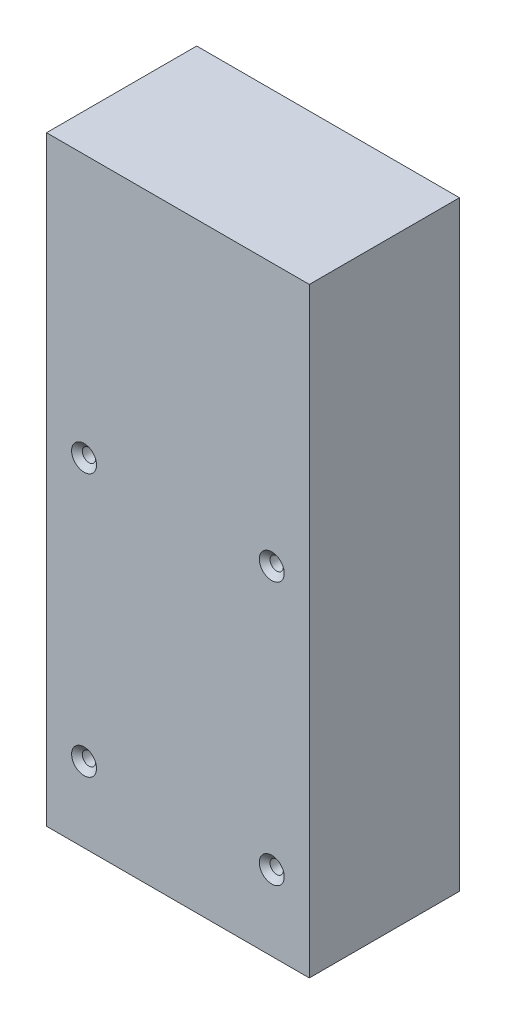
ISO-10303-21;
HEADER;
FILE_DESCRIPTION(('STEP AP214'),'2;1');
FILE_NAME('part.step','',(''),(''),'','','');
FILE_SCHEMA(('AUTOMOTIVE_DESIGN { 1 0 10303 214 1 1 1 1 }'));
ENDSEC;
DATA;
#1=APPLICATION_CONTEXT('core data for automotive mechanical design processes');
#2=APPLICATION_PROTOCOL_DEFINITION('international standard','automotive_design',2000,#1);
#3=PRODUCT_CONTEXT('',#1,'mechanical');
#4=PRODUCT('Part','Part','',(#3));
#5=PRODUCT_RELATED_PRODUCT_CATEGORY('part','',(#4));
#6=PRODUCT_DEFINITION_FORMATION('','',#4);
#7=PRODUCT_DEFINITION_CONTEXT('part definition',#1,'design');
#8=PRODUCT_DEFINITION('design','',#6,#7);
#9=PRODUCT_DEFINITION_SHAPE('','',#8);
#10=(LENGTH_UNIT() NAMED_UNIT(*) SI_UNIT(.MILLI.,.METRE.));
#11=(NAMED_UNIT(*) PLANE_ANGLE_UNIT() SI_UNIT($,.RADIAN.));
#12=(NAMED_UNIT(*) SI_UNIT($,.STERADIAN.) SOLID_ANGLE_UNIT());
#13=UNCERTAINTY_MEASURE_WITH_UNIT(LENGTH_MEASURE(1.E-05),#10,'distance_accuracy_value','');
#14=(GEOMETRIC_REPRESENTATION_CONTEXT(3) GLOBAL_UNCERTAINTY_ASSIGNED_CONTEXT((#13)) GLOBAL_UNIT_ASSIGNED_CONTEXT((#10,
#11,#12)) REPRESENTATION_CONTEXT('',''));
#15=CARTESIAN_POINT('',(0.,0.,0.));
#16=DIRECTION('',(0.,0.,1.));
#17=DIRECTION('',(1.,0.,0.));
#18=AXIS2_PLACEMENT_3D('',#15,#16,#17);
#19=CARTESIAN_POINT('',(44.45,203.2,-25.4));
#20=DIRECTION('',(-1.,0.,0.));
#21=DIRECTION('',(0.,0.,1.));
#22=AXIS2_PLACEMENT_3D('',#19,#20,#21);
#23=PLANE('',#22);
#24=DIRECTION('',(0.,0.,-1.));
#25=VECTOR('',#24,1.);
#26=CARTESIAN_POINT('',(44.45,0.,-25.4));
#27=LINE('',#26,#25);
#28=CARTESIAN_POINT('',(44.45,0.,25.4));
#29=VERTEX_POINT('',#28);
#30=CARTESIAN_POINT('',(44.45,0.,-25.4));
#31=VERTEX_POINT('',#30);
#32=EDGE_CURVE('E97',#29,#31,#27,.T.);
#33=ORIENTED_EDGE('',*,*,#32,.T.);
#34=DIRECTION('',(0.,-1.,0.));
#35=VECTOR('',#34,1.);
#36=CARTESIAN_POINT('',(44.45,203.2,-25.4));
#37=LINE('',#36,#35);
#38=CARTESIAN_POINT('',(44.45,203.2,-25.4));
#39=VERTEX_POINT('',#38);
#40=EDGE_CURVE('E11',#39,#31,#37,.T.);
#41=ORIENTED_EDGE('',*,*,#40,.F.);
#42=DIRECTION('',(0.,0.,-1.));
#43=VECTOR('',#42,1.);
#44=CARTESIAN_POINT('',(44.45,203.2,-25.4));
#45=LINE('',#44,#43);
#46=CARTESIAN_POINT('',(44.45,203.2,25.4));
#47=VERTEX_POINT('',#46);
#48=EDGE_CURVE('E85',#47,#39,#45,.T.);
#49=ORIENTED_EDGE('',*,*,#48,.F.);
#50=DIRECTION('',(0.,-1.,0.));
#51=VECTOR('',#50,1.);
#52=CARTESIAN_POINT('',(44.45,203.2,25.4));
#53=LINE('',#52,#51);
#54=EDGE_CURVE('E93',#47,#29,#53,.T.);
#55=ORIENTED_EDGE('',*,*,#54,.T.);
#56=EDGE_LOOP('',(#33,#41,#49,#55));
#57=FACE_BOUND('',#56,.T.);
#58=ADVANCED_FACE('F34',(#57),#23,.F.);
#59=CARTESIAN_POINT('',(-44.45,203.2,-25.4));
#60=DIRECTION('',(0.,0.,1.));
#61=DIRECTION('',(1.,0.,0.));
#62=AXIS2_PLACEMENT_3D('',#59,#60,#61);
#63=PLANE('',#62);
#64=CARTESIAN_POINT('',(-31.75,25.4,-25.4));
#65=DIRECTION('',(0.,0.,1.));
#66=DIRECTION('',(1.,0.,0.));
#67=AXIS2_PLACEMENT_3D('',#64,#65,#66);
#68=CIRCLE('',#67,2.24789999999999);
#69=CARTESIAN_POINT('',(-29.5021,25.4,-25.4));
#70=VERTEX_POINT('',#69);
#71=EDGE_CURVE('E137',#70,#70,#68,.T.);
#72=ORIENTED_EDGE('',*,*,#71,.T.);
#73=EDGE_LOOP('',(#72));
#74=FACE_BOUND('',#73,.T.);
#75=CARTESIAN_POINT('',(31.75,25.4,-25.4));
#76=DIRECTION('',(0.,0.,1.));
#77=DIRECTION('',(1.,0.,0.));
#78=AXIS2_PLACEMENT_3D('',#75,#76,#77);
#79=CIRCLE('',#78,2.24789999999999);
#80=CARTESIAN_POINT('',(33.9979,25.4,-25.4));
#81=VERTEX_POINT('',#80);
#82=EDGE_CURVE('E128',#81,#81,#79,.T.);
#83=ORIENTED_EDGE('',*,*,#82,.T.);
#84=EDGE_LOOP('',(#83));
#85=FACE_BOUND('',#84,.T.);
#86=CARTESIAN_POINT('',(-31.75,114.3,-25.4));
#87=DIRECTION('',(0.,0.,1.));
#88=DIRECTION('',(1.,0.,0.));
#89=AXIS2_PLACEMENT_3D('',#86,#87,#88);
#90=CIRCLE('',#89,2.24789999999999);
#91=CARTESIAN_POINT('',(-29.5021,114.3,-25.4));
#92=VERTEX_POINT('',#91);
#93=EDGE_CURVE('E119',#92,#92,#90,.T.);
#94=ORIENTED_EDGE('',*,*,#93,.T.);
#95=EDGE_LOOP('',(#94));
#96=FACE_BOUND('',#95,.T.);
#97=CARTESIAN_POINT('',(31.75,114.3,-25.4));
#98=DIRECTION('',(0.,0.,1.));
#99=DIRECTION('',(1.,0.,0.));
#100=AXIS2_PLACEMENT_3D('',#97,#98,#99);
#101=CIRCLE('',#100,2.24789999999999);
#102=CARTESIAN_POINT('',(33.9979,114.3,-25.4));
#103=VERTEX_POINT('',#102);
#104=EDGE_CURVE('E100',#103,#103,#101,.T.);
#105=ORIENTED_EDGE('',*,*,#104,.T.);
#106=EDGE_LOOP('',(#105));
#107=FACE_BOUND('',#106,.T.);
#108=DIRECTION('',(-1.,0.,0.));
#109=VECTOR('',#108,1.);
#110=CARTESIAN_POINT('',(-44.45,0.,-25.4));
#111=LINE('',#110,#109);
#112=CARTESIAN_POINT('',(-44.45,0.,-25.4));
#113=VERTEX_POINT('',#112);
#114=EDGE_CURVE('E89',#31,#113,#111,.T.);
#115=ORIENTED_EDGE('',*,*,#114,.T.);
#116=DIRECTION('',(0.,-1.,0.));
#117=VECTOR('',#116,1.);
#118=CARTESIAN_POINT('',(-44.45,203.2,-25.4));
#119=LINE('',#118,#117);
#120=CARTESIAN_POINT('',(-44.45,203.2,-25.4));
#121=VERTEX_POINT('',#120);
#122=EDGE_CURVE('E42',#121,#113,#119,.T.);
#123=ORIENTED_EDGE('',*,*,#122,.F.);
#124=DIRECTION('',(-1.,0.,0.));
#125=VECTOR('',#124,1.);
#126=CARTESIAN_POINT('',(-44.45,203.2,-25.4));
#127=LINE('',#126,#125);
#128=EDGE_CURVE('E80',#39,#121,#127,.T.);
#129=ORIENTED_EDGE('',*,*,#128,.F.);
#130=ORIENTED_EDGE('',*,*,#40,.T.);
#131=EDGE_LOOP('',(#115,#123,#129,#130));
#132=FACE_BOUND('',#131,.T.);
#133=ADVANCED_FACE('F88',(#74,#85,#96,#107,#132),#63,.F.);
#134=CARTESIAN_POINT('',(-44.45,203.2,-25.4));
#135=DIRECTION('',(1.,0.,0.));
#136=DIRECTION('',(0.,0.,-1.));
#137=AXIS2_PLACEMENT_3D('',#134,#135,#136);
#138=PLANE('',#137);
#139=DIRECTION('',(0.,0.,1.));
#140=VECTOR('',#139,1.);
#141=CARTESIAN_POINT('',(-44.45,0.,-25.4));
#142=LINE('',#141,#140);
#143=CARTESIAN_POINT('',(-44.45,0.,25.4));
#144=VERTEX_POINT('',#143);
#145=EDGE_CURVE('E67',#113,#144,#142,.T.);
#146=ORIENTED_EDGE('',*,*,#145,.T.);
#147=DIRECTION('',(0.,-1.,0.));
#148=VECTOR('',#147,1.);
#149=CARTESIAN_POINT('',(-44.45,203.2,25.4));
#150=LINE('',#149,#148);
#151=CARTESIAN_POINT('',(-44.45,203.2,25.4));
#152=VERTEX_POINT('',#151);
#153=EDGE_CURVE('E90',#152,#144,#150,.T.);
#154=ORIENTED_EDGE('',*,*,#153,.F.);
#155=DIRECTION('',(0.,0.,1.));
#156=VECTOR('',#155,1.);
#157=CARTESIAN_POINT('',(-44.45,203.2,-25.4));
#158=LINE('',#157,#156);
#159=EDGE_CURVE('E83',#121,#152,#158,.T.);
#160=ORIENTED_EDGE('',*,*,#159,.F.);
#161=ORIENTED_EDGE('',*,*,#122,.T.);
#162=EDGE_LOOP('',(#146,#154,#160,#161));
#163=FACE_BOUND('',#162,.T.);
#164=ADVANCED_FACE('F91',(#163),#138,.F.);
#165=CARTESIAN_POINT('',(-44.45,203.2,25.4));
#166=DIRECTION('',(0.,0.,-1.));
#167=DIRECTION('',(-1.,0.,0.));
#168=AXIS2_PLACEMENT_3D('',#165,#166,#167);
#169=PLANE('',#168);
#170=CARTESIAN_POINT('',(-31.75,25.4,25.4));
#171=DIRECTION('',(0.,0.,1.));
#172=DIRECTION('',(1.,0.,0.));
#173=AXIS2_PLACEMENT_3D('',#170,#171,#172);
#174=CIRCLE('',#173,4.2164);
#175=CARTESIAN_POINT('',(-27.5336,25.4,25.4));
#176=VERTEX_POINT('',#175);
#177=EDGE_CURVE('E143',#176,#176,#174,.T.);
#178=ORIENTED_EDGE('',*,*,#177,.F.);
#179=EDGE_LOOP('',(#178));
#180=FACE_BOUND('',#179,.T.);
#181=CARTESIAN_POINT('',(31.75,25.4,25.4));
#182=DIRECTION('',(0.,0.,1.));
#183=DIRECTION('',(1.,0.,0.));
#184=AXIS2_PLACEMENT_3D('',#181,#182,#183);
#185=CIRCLE('',#184,4.2164);
#186=CARTESIAN_POINT('',(35.9664,25.4,25.4));
#187=VERTEX_POINT('',#186);
#188=EDGE_CURVE('E134',#187,#187,#185,.T.);
#189=ORIENTED_EDGE('',*,*,#188,.F.);
#190=EDGE_LOOP('',(#189));
#191=FACE_BOUND('',#190,.T.);
#192=CARTESIAN_POINT('',(-31.75,114.3,25.4));
#193=DIRECTION('',(0.,0.,1.));
#194=DIRECTION('',(1.,0.,0.));
#195=AXIS2_PLACEMENT_3D('',#192,#193,#194);
#196=CIRCLE('',#195,4.2164);
#197=CARTESIAN_POINT('',(-27.5336,114.3,25.4));
#198=VERTEX_POINT('',#197);
#199=EDGE_CURVE('E125',#198,#198,#196,.T.);
#200=ORIENTED_EDGE('',*,*,#199,.F.);
#201=EDGE_LOOP('',(#200));
#202=FACE_BOUND('',#201,.T.);
#203=CARTESIAN_POINT('',(31.75,114.3,25.4));
#204=DIRECTION('',(0.,0.,1.));
#205=DIRECTION('',(1.,0.,0.));
#206=AXIS2_PLACEMENT_3D('',#203,#204,#205);
#207=CIRCLE('',#206,4.2164);
#208=CARTESIAN_POINT('',(35.9664,114.3,25.4));
#209=VERTEX_POINT('',#208);
#210=EDGE_CURVE('E116',#209,#209,#207,.T.);
#211=ORIENTED_EDGE('',*,*,#210,.F.);
#212=EDGE_LOOP('',(#211));
#213=FACE_BOUND('',#212,.T.);
#214=DIRECTION('',(1.,0.,0.));
#215=VECTOR('',#214,1.);
#216=CARTESIAN_POINT('',(-44.45,0.,25.4));
#217=LINE('',#216,#215);
#218=EDGE_CURVE('E73',#144,#29,#217,.T.);
#219=ORIENTED_EDGE('',*,*,#218,.T.);
#220=ORIENTED_EDGE('',*,*,#54,.F.);
#221=DIRECTION('',(1.,0.,0.));
#222=VECTOR('',#221,1.);
#223=CARTESIAN_POINT('',(-44.45,203.2,25.4));
#224=LINE('',#223,#222);
#225=EDGE_CURVE('E50',#152,#47,#224,.T.);
#226=ORIENTED_EDGE('',*,*,#225,.F.);
#227=ORIENTED_EDGE('',*,*,#153,.T.);
#228=EDGE_LOOP('',(#219,#220,#226,#227));
#229=FACE_BOUND('',#228,.T.);
#230=ADVANCED_FACE('F105',(#180,#191,#202,#213,#229),#169,.F.);
#231=CARTESIAN_POINT('',(0.,203.2,0.));
#232=DIRECTION('',(0.,1.,0.));
#233=DIRECTION('',(0.,0.,1.));
#234=AXIS2_PLACEMENT_3D('',#231,#232,#233);
#235=PLANE('',#234);
#236=ORIENTED_EDGE('',*,*,#48,.T.);
#237=ORIENTED_EDGE('',*,*,#128,.T.);
#238=ORIENTED_EDGE('',*,*,#159,.T.);
#239=ORIENTED_EDGE('',*,*,#225,.T.);
#240=EDGE_LOOP('',(#236,#237,#238,#239));
#241=FACE_BOUND('',#240,.T.);
#242=ADVANCED_FACE('F81',(#241),#235,.T.);
#243=CARTESIAN_POINT('',(0.,0.,0.));
#244=DIRECTION('',(0.,1.,0.));
#245=DIRECTION('',(0.,0.,1.));
#246=AXIS2_PLACEMENT_3D('',#243,#244,#245);
#247=PLANE('',#246);
#248=ORIENTED_EDGE('',*,*,#32,.F.);
#249=ORIENTED_EDGE('',*,*,#218,.F.);
#250=ORIENTED_EDGE('',*,*,#145,.F.);
#251=ORIENTED_EDGE('',*,*,#114,.F.);
#252=EDGE_LOOP('',(#248,#249,#250,#251));
#253=FACE_BOUND('',#252,.T.);
#254=ADVANCED_FACE('F108',(#253),#247,.F.);
#255=CARTESIAN_POINT('',(31.75,114.3,25.4));
#256=DIRECTION('',(0.,0.,1.));
#257=DIRECTION('',(1.,0.,0.));
#258=AXIS2_PLACEMENT_3D('',#255,#256,#257);
#259=CYLINDRICAL_SURFACE('',#258,2.24789999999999);
#260=ORIENTED_EDGE('',*,*,#104,.F.);
#261=EDGE_LOOP('',(#260));
#262=FACE_BOUND('',#261,.T.);
#263=CARTESIAN_POINT('',(31.75,114.3,23.7482323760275));
#264=DIRECTION('',(0.,0.,1.));
#265=DIRECTION('',(1.,0.,0.));
#266=AXIS2_PLACEMENT_3D('',#263,#264,#265);
#267=CIRCLE('',#266,2.24789999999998);
#268=CARTESIAN_POINT('',(33.9979,114.3,23.7482323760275));
#269=VERTEX_POINT('',#268);
#270=EDGE_CURVE('E113',#269,#269,#267,.T.);
#271=ORIENTED_EDGE('',*,*,#270,.T.);
#272=EDGE_LOOP('',(#271));
#273=FACE_BOUND('',#272,.T.);
#274=ADVANCED_FACE('F161',(#262,#273),#259,.F.);
#275=CARTESIAN_POINT('',(31.75,114.3,25.4));
#276=DIRECTION('',(0.,0.,1.));
#277=DIRECTION('',(1.,0.,0.));
#278=AXIS2_PLACEMENT_3D('',#275,#276,#277);
#279=CONICAL_SURFACE('',#278,4.2164,0.872664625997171);
#280=ORIENTED_EDGE('',*,*,#270,.F.);
#281=EDGE_LOOP('',(#280));
#282=FACE_BOUND('',#281,.T.);
#283=ORIENTED_EDGE('',*,*,#210,.T.);
#284=EDGE_LOOP('',(#283));
#285=FACE_BOUND('',#284,.T.);
#286=ADVANCED_FACE('F158',(#282,#285),#279,.F.);
#287=CARTESIAN_POINT('',(-31.75,114.3,25.4));
#288=DIRECTION('',(0.,0.,1.));
#289=DIRECTION('',(1.,0.,0.));
#290=AXIS2_PLACEMENT_3D('',#287,#288,#289);
#291=CYLINDRICAL_SURFACE('',#290,2.24789999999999);
#292=ORIENTED_EDGE('',*,*,#93,.F.);
#293=EDGE_LOOP('',(#292));
#294=FACE_BOUND('',#293,.T.);
#295=CARTESIAN_POINT('',(-31.75,114.3,23.7482323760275));
#296=DIRECTION('',(0.,0.,1.));
#297=DIRECTION('',(1.,0.,0.));
#298=AXIS2_PLACEMENT_3D('',#295,#296,#297);
#299=CIRCLE('',#298,2.24789999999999);
#300=CARTESIAN_POINT('',(-29.5021,114.3,23.7482323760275));
#301=VERTEX_POINT('',#300);
#302=EDGE_CURVE('E122',#301,#301,#299,.T.);
#303=ORIENTED_EDGE('',*,*,#302,.T.);
#304=EDGE_LOOP('',(#303));
#305=FACE_BOUND('',#304,.T.);
#306=ADVANCED_FACE('F160',(#294,#305),#291,.F.);
#307=CARTESIAN_POINT('',(-31.75,114.3,25.4));
#308=DIRECTION('',(0.,0.,1.));
#309=DIRECTION('',(1.,0.,0.));
#310=AXIS2_PLACEMENT_3D('',#307,#308,#309);
#311=CONICAL_SURFACE('',#310,4.2164,0.872664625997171);
#312=ORIENTED_EDGE('',*,*,#302,.F.);
#313=EDGE_LOOP('',(#312));
#314=FACE_BOUND('',#313,.T.);
#315=ORIENTED_EDGE('',*,*,#199,.T.);
#316=EDGE_LOOP('',(#315));
#317=FACE_BOUND('',#316,.T.);
#318=ADVANCED_FACE('F168',(#314,#317),#311,.F.);
#319=CARTESIAN_POINT('',(31.75,25.4,25.4));
#320=DIRECTION('',(0.,0.,1.));
#321=DIRECTION('',(1.,0.,0.));
#322=AXIS2_PLACEMENT_3D('',#319,#320,#321);
#323=CYLINDRICAL_SURFACE('',#322,2.24789999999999);
#324=ORIENTED_EDGE('',*,*,#82,.F.);
#325=EDGE_LOOP('',(#324));
#326=FACE_BOUND('',#325,.T.);
#327=CARTESIAN_POINT('',(31.75,25.4,23.7482323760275));
#328=DIRECTION('',(0.,0.,1.));
#329=DIRECTION('',(1.,0.,0.));
#330=AXIS2_PLACEMENT_3D('',#327,#328,#329);
#331=CIRCLE('',#330,2.24789999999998);
#332=CARTESIAN_POINT('',(33.9979,25.4,23.7482323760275));
#333=VERTEX_POINT('',#332);
#334=EDGE_CURVE('E131',#333,#333,#331,.T.);
#335=ORIENTED_EDGE('',*,*,#334,.T.);
#336=EDGE_LOOP('',(#335));
#337=FACE_BOUND('',#336,.T.);
#338=ADVANCED_FACE('F222',(#326,#337),#323,.F.);
#339=CARTESIAN_POINT('',(31.75,25.4,25.4));
#340=DIRECTION('',(0.,0.,1.));
#341=DIRECTION('',(1.,0.,0.));
#342=AXIS2_PLACEMENT_3D('',#339,#340,#341);
#343=CONICAL_SURFACE('',#342,4.2164,0.872664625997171);
#344=ORIENTED_EDGE('',*,*,#334,.F.);
#345=EDGE_LOOP('',(#344));
#346=FACE_BOUND('',#345,.T.);
#347=ORIENTED_EDGE('',*,*,#188,.T.);
#348=EDGE_LOOP('',(#347));
#349=FACE_BOUND('',#348,.T.);
#350=ADVANCED_FACE('F232',(#346,#349),#343,.F.);
#351=CARTESIAN_POINT('',(-31.75,25.4,25.4));
#352=DIRECTION('',(0.,0.,1.));
#353=DIRECTION('',(1.,0.,0.));
#354=AXIS2_PLACEMENT_3D('',#351,#352,#353);
#355=CYLINDRICAL_SURFACE('',#354,2.24789999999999);
#356=ORIENTED_EDGE('',*,*,#71,.F.);
#357=EDGE_LOOP('',(#356));
#358=FACE_BOUND('',#357,.T.);
#359=CARTESIAN_POINT('',(-31.75,25.4,23.7482323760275));
#360=DIRECTION('',(0.,0.,1.));
#361=DIRECTION('',(1.,0.,0.));
#362=AXIS2_PLACEMENT_3D('',#359,#360,#361);
#363=CIRCLE('',#362,2.24789999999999);
#364=CARTESIAN_POINT('',(-29.5021,25.4,23.7482323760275));
#365=VERTEX_POINT('',#364);
#366=EDGE_CURVE('E140',#365,#365,#363,.T.);
#367=ORIENTED_EDGE('',*,*,#366,.T.);
#368=EDGE_LOOP('',(#367));
#369=FACE_BOUND('',#368,.T.);
#370=ADVANCED_FACE('F242',(#358,#369),#355,.F.);
#371=CARTESIAN_POINT('',(-31.75,25.4,25.4));
#372=DIRECTION('',(0.,0.,1.));
#373=DIRECTION('',(1.,0.,0.));
#374=AXIS2_PLACEMENT_3D('',#371,#372,#373);
#375=CONICAL_SURFACE('',#374,4.2164,0.872664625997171);
#376=ORIENTED_EDGE('',*,*,#366,.F.);
#377=EDGE_LOOP('',(#376));
#378=FACE_BOUND('',#377,.T.);
#379=ORIENTED_EDGE('',*,*,#177,.T.);
#380=EDGE_LOOP('',(#379));
#381=FACE_BOUND('',#380,.T.);
#382=ADVANCED_FACE('F147',(#378,#381),#375,.F.);
#383=CLOSED_SHELL('',(#58,#133,#164,#230,#242,#254,#274,#286,#306,#318,#338,#350,#370,#382));
#384=MANIFOLD_SOLID_BREP('B2',#383);
#385=ADVANCED_BREP_SHAPE_REPRESENTATION('',(#18,#384),#14);
#386=SHAPE_DEFINITION_REPRESENTATION(#9,#385);
ENDSEC;
END-ISO-10303-21;
